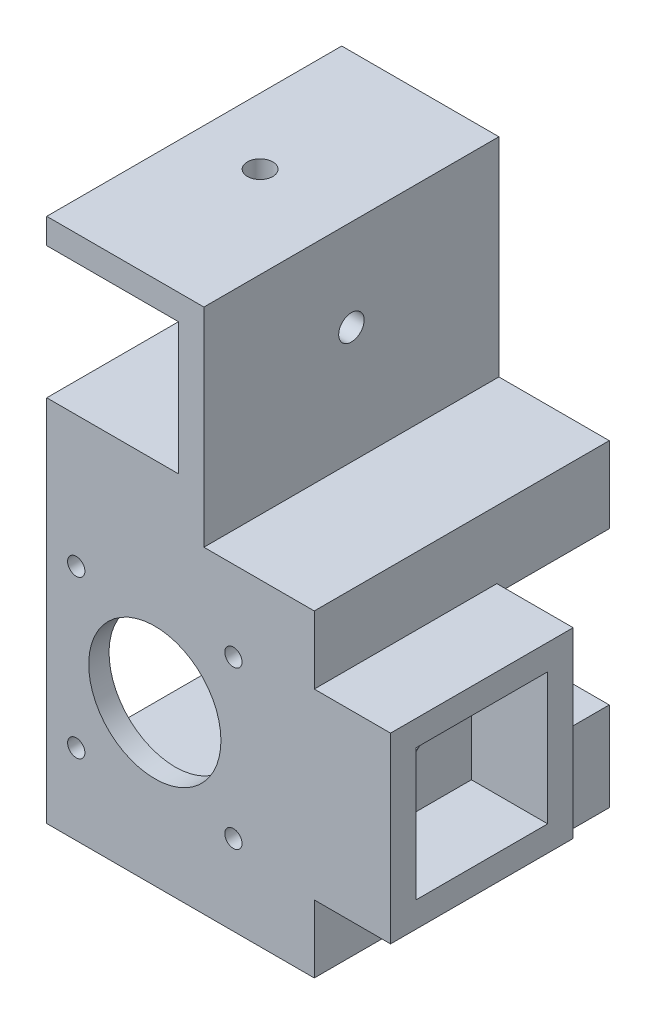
from build123d import *

# Parameters (mm, degrees)
SKETCH2_W            = 62.5
SKETCH2_H            = 62.5
SKETCH2_W_2          = 42.5
SKETCH2_H_2          = 42.5
BOSS_EXTRUDE2_DEPTH  = 48
SKETCH3_W            = 62.5
SKETCH3_H            = 62.5
SKETCH3_R            = 13
BOSS_EXTRUDE3_DEPTH  = 10
SKETCH15_W           = 58
SKETCH15_H           = 62.5
BOSS_EXTRUDE8_DEPTH  = 0.1
SKETCH16_W           = 35.9
SKETCH16_H           = 35.9
SKETCH16_W_2         = 25.9
SKETCH16_H_2         = 25.9
BOSS_EXTRUDE9_DEPTH  = 20
SKETCH17_R           = 3.43
CUT_EXTRUDE2_DEPTH   = 10
SKETCH18_R           = 7
CUT_EXTRUDE3_DEPTH   = 10
SKETCH19_R           = 1.7
CUT_EXTRUDE4_DEPTH   = 10
SKETCH20_W           = 40.9
SKETCH20_H           = 58
BOSS_EXTRUDE10_DEPTH = 45.9
BOSS_EXTRUDE12_DEPTH = 20
SKETCH35_W           = 22.1
SKETCH35_H           = 30
CUT_EXTRUDE11_DEPTH  = 111.339850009
SKETCH37_W           = 25.9
SKETCH37_H           = 25.9
CUT_EXTRUDE12_DEPTH  = 110.329524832
CUT_EXTRUDE13_DEPTH  = 110.329524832
SKETCH39_W           = 30.9
SKETCH39_H           = 20
CUT_EXTRUDE14_DEPTH  = 126.029526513
SKETCH40_R           = 2.5
CUT_EXTRUDE15_DEPTH  = 97.169186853
SKETCH41_R           = 2.5
CUT_EXTRUDE16_DEPTH  = 10
SKETCH42_W           = 5
SKETCH42_H           = 35.9
CUT_EXTRUDE17_DEPTH  = 89.76070358
SKETCH46_W           = 6
SKETCH46_H           = 42.5
CUT_EXTRUDE19_DEPTH  = 42.5


with BuildPart() as part:
    # Sketch2 → Boss-Extrude2 (new body)
    with BuildSketch(Plane.XY):
        Rectangle(SKETCH2_W, SKETCH2_H)
        Rectangle(SKETCH2_W_2, SKETCH2_H_2, mode=Mode.SUBTRACT)
    extrude(amount=-BOSS_EXTRUDE2_DEPTH)

    # Sketch3 → Boss-Extrude3 (add)
    with BuildSketch(Plane.XY):
        Rectangle(SKETCH3_W, SKETCH3_H)
        Circle(SKETCH3_R, mode=Mode.SUBTRACT)
    extrude(amount=BOSS_EXTRUDE3_DEPTH)

    # Sketch15 → Boss-Extrude8 (add)
    with BuildSketch(Plane(origin=(31.25, 0, 0), x_dir=(0, 0, -1), z_dir=(1, 0, 0))):
        with Locations((19, 0)):
            Rectangle(SKETCH15_W, SKETCH15_H)
    extrude(amount=BOSS_EXTRUDE8_DEPTH)

    # Sketch16 → Boss-Extrude9 (add)
    with BuildSketch(Plane(origin=(31.35, 0, 0), x_dir=(0, 0, -1), z_dir=(1, 0, 0))):
        with Locations((7.95, 0)):
            Rectangle(SKETCH16_W, SKETCH16_H)
        with Locations((7.95, 0)):
            Rectangle(SKETCH16_W_2, SKETCH16_H_2, mode=Mode.SUBTRACT)
    extrude(amount=BOSS_EXTRUDE9_DEPTH)

    # Sketch17 → Cut-Extrude2 (cut)
    with BuildSketch(Plane(origin=(31.35, 0, 0), x_dir=(0, 0, -1), z_dir=(1, 0, 0))):
        with Locations((7.95, 0)):
            Circle(SKETCH17_R)
    extrude(amount=-CUT_EXTRUDE2_DEPTH, mode=Mode.SUBTRACT)

    # Sketch18 → Cut-Extrude3 (cut)
    with BuildSketch(Plane.ZY.offset(-21.25)):
        with Locations((-7.95, 0)):
            Circle(SKETCH18_R)
    extrude(amount=-CUT_EXTRUDE3_DEPTH, mode=Mode.SUBTRACT)

    # Sketch19 → Cut-Extrude4 (cut)
    with BuildSketch(Plane.XY.offset(10)):
        with Locations((-15.45, 15.45)):
            Circle(SKETCH19_R)
        with Locations((15.45, 15.45)):
            Circle(SKETCH19_R)
        with Locations((15.45, -15.45)):
            Circle(SKETCH19_R)
        with Locations((-15.45, -15.45)):
            Circle(SKETCH19_R)
    extrude(amount=-CUT_EXTRUDE4_DEPTH, mode=Mode.SUBTRACT)

    # Sketch20 → Boss-Extrude10 (add)
    with BuildSketch(Plane(origin=(0, 31.25, 0), x_dir=(1, 0, 0), z_dir=(0, 1, 0))):
        with Locations((-10.8, 19)):
            Rectangle(SKETCH20_W, SKETCH20_H)
    extrude(amount=BOSS_EXTRUDE10_DEPTH)

    # Sketch24 → Boss-Extrude12 (add)
    with BuildSketch(Plane.XY.offset(10)):
        Polygon((9.65, 72.15), (-21.25, 72.15), (-21.25, 67.15), (4.65, 67.15), (4.65, 41.25), (-21.25, 41.25), (-21.25, 36.25), (9.65, 36.25), align=None)
    extrude(amount=BOSS_EXTRUDE12_DEPTH)

    # Sketch35 → Cut-Extrude11 (cut, through all)
    with BuildSketch(Plane(origin=(31.35, 0, 0), x_dir=(0, 0, -1), z_dir=(1, 0, 0))):
        with Locations((36.95, 1.25)):
            Rectangle(SKETCH35_W, SKETCH35_H)
    extrude(amount=-CUT_EXTRUDE11_DEPTH, mode=Mode.SUBTRACT)

    # Sketch37 → Cut-Extrude12 (cut, through all)
    with BuildSketch(Plane.XY.offset(10)):
        with Locations((-8.3, 54.2)):
            Rectangle(SKETCH37_W, SKETCH37_H)
    extrude(amount=-CUT_EXTRUDE12_DEPTH, mode=Mode.SUBTRACT)

    # Sketch38 → Cut-Extrude13 (cut, through all)
    with BuildSketch(Plane.XY.offset(10)):
        Polygon((9.65, 72.15), (9.65, 77.15), (-31.25, 77.15), (-31.25, -31.25), (-21.25, -31.25), (-21.25, 72.15), align=None)
    extrude(amount=-CUT_EXTRUDE13_DEPTH, mode=Mode.SUBTRACT)

    # Sketch39 → Cut-Extrude14 (cut, through all)
    with BuildSketch(Plane(origin=(0, 72.15, 0), x_dir=(1, 0, 0), z_dir=(0, 1, 0))):
        with Locations((-5.8, -20)):
            Rectangle(SKETCH39_W, SKETCH39_H)
    extrude(amount=-CUT_EXTRUDE14_DEPTH, mode=Mode.SUBTRACT)

    # Sketch40 → Cut-Extrude15 (cut, through all)
    with BuildSketch(Plane(origin=(9.65, 0, 0), x_dir=(0, 0, -1), z_dir=(1, 0, 0))):
        with Locations((19, 54.2)):
            Circle(SKETCH40_R)
    extrude(amount=-CUT_EXTRUDE15_DEPTH, mode=Mode.SUBTRACT)

    # Sketch41 → Cut-Extrude16 (cut)
    with BuildSketch(Plane(origin=(0, 72.15, 0), x_dir=(1, 0, 0), z_dir=(0, 1, 0))):
        with Locations(Location((-8.3, 19, 0), (0, 0, 270))):
            Circle(SKETCH41_R)
    extrude(amount=-CUT_EXTRUDE16_DEPTH, mode=Mode.SUBTRACT)

    # Sketch42 → Cut-Extrude17 (cut, through all)
    with BuildSketch(Plane(origin=(0, 17.95, 0), x_dir=(1, 0, 0), z_dir=(0, 1, 0))):
        with Locations((48.85, 7.95)):
            Rectangle(SKETCH42_W, SKETCH42_H)
    extrude(amount=-CUT_EXTRUDE17_DEPTH, mode=Mode.SUBTRACT)

    # Sketch46 → Cut-Extrude19 (cut)
    with BuildSketch(Plane.ZY.offset(21.25)):
        with Locations((3, 0)):
            Rectangle(SKETCH46_W, SKETCH46_H)
    extrude(amount=-CUT_EXTRUDE19_DEPTH, mode=Mode.SUBTRACT)


solid = part.part
